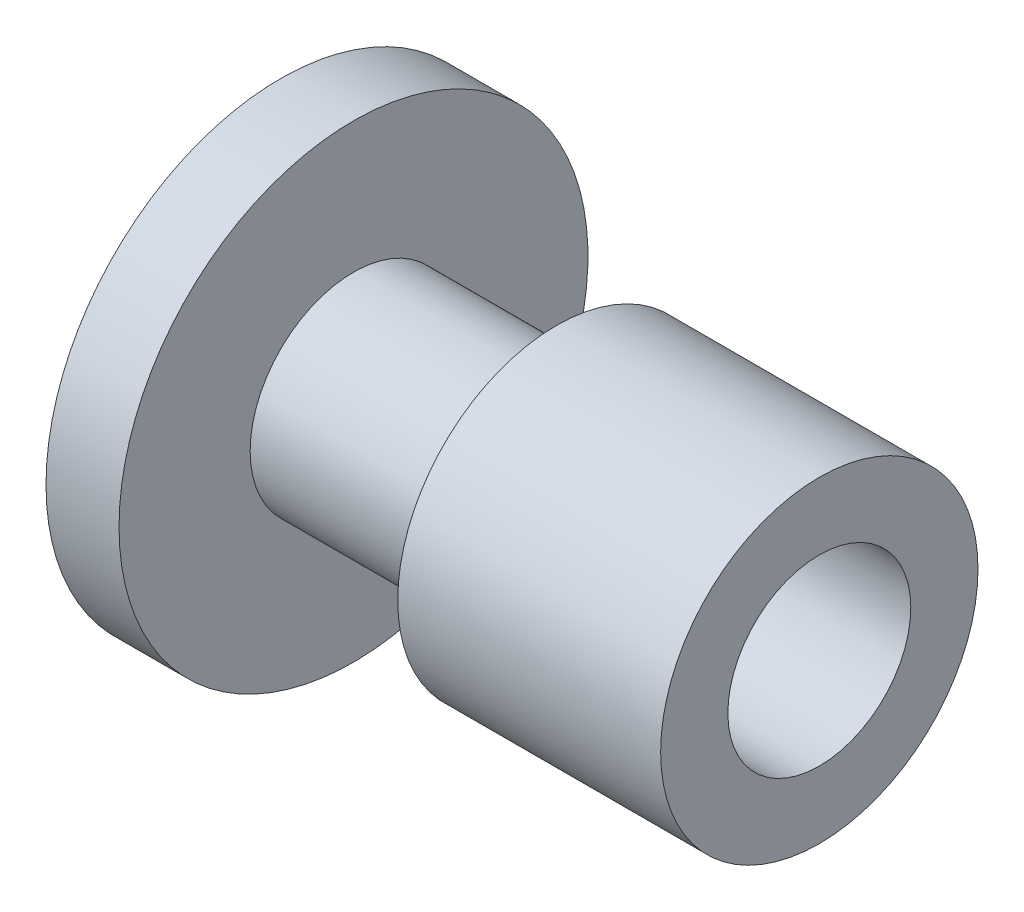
ISO-10303-21;
HEADER;
FILE_DESCRIPTION(('STEP AP214'),'2;1');
FILE_NAME('part.step','',(''),(''),'','','');
FILE_SCHEMA(('AUTOMOTIVE_DESIGN { 1 0 10303 214 1 1 1 1 }'));
ENDSEC;
DATA;
#1=APPLICATION_CONTEXT('core data for automotive mechanical design processes');
#2=APPLICATION_PROTOCOL_DEFINITION('international standard','automotive_design',2000,#1);
#3=PRODUCT_CONTEXT('',#1,'mechanical');
#4=PRODUCT('Part','Part','',(#3));
#5=PRODUCT_RELATED_PRODUCT_CATEGORY('part','',(#4));
#6=PRODUCT_DEFINITION_FORMATION('','',#4);
#7=PRODUCT_DEFINITION_CONTEXT('part definition',#1,'design');
#8=PRODUCT_DEFINITION('design','',#6,#7);
#9=PRODUCT_DEFINITION_SHAPE('','',#8);
#10=(LENGTH_UNIT() NAMED_UNIT(*) SI_UNIT(.MILLI.,.METRE.));
#11=(NAMED_UNIT(*) PLANE_ANGLE_UNIT() SI_UNIT($,.RADIAN.));
#12=(NAMED_UNIT(*) SI_UNIT($,.STERADIAN.) SOLID_ANGLE_UNIT());
#13=UNCERTAINTY_MEASURE_WITH_UNIT(LENGTH_MEASURE(1.E-05),#10,'distance_accuracy_value','');
#14=(GEOMETRIC_REPRESENTATION_CONTEXT(3) GLOBAL_UNCERTAINTY_ASSIGNED_CONTEXT((#13)) GLOBAL_UNIT_ASSIGNED_CONTEXT((#10,
#11,#12)) REPRESENTATION_CONTEXT('',''));
#15=CARTESIAN_POINT('',(0.,0.,0.));
#16=DIRECTION('',(0.,0.,1.));
#17=DIRECTION('',(1.,0.,0.));
#18=AXIS2_PLACEMENT_3D('',#15,#16,#17);
#19=CARTESIAN_POINT('',(0.,0.,0.));
#20=DIRECTION('',(-1.,0.,0.));
#21=DIRECTION('',(0.,0.,1.));
#22=AXIS2_PLACEMENT_3D('',#19,#20,#21);
#23=CYLINDRICAL_SURFACE('',#22,30.3529754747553);
#24=CARTESIAN_POINT('',(0.,0.,0.));
#25=DIRECTION('',(-1.,0.,0.));
#26=DIRECTION('',(0.,0.,1.));
#27=AXIS2_PLACEMENT_3D('',#24,#25,#26);
#28=CIRCLE('',#27,30.3529754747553);
#29=CARTESIAN_POINT('',(0.,0.,30.3529754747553));
#30=VERTEX_POINT('',#29);
#31=EDGE_CURVE('E69',#30,#30,#28,.T.);
#32=ORIENTED_EDGE('',*,*,#31,.F.);
#33=EDGE_LOOP('',(#32));
#34=FACE_BOUND('',#33,.T.);
#35=CARTESIAN_POINT('',(9.45341203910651,0.,0.));
#36=DIRECTION('',(-1.,0.,0.));
#37=DIRECTION('',(0.,0.,1.));
#38=AXIS2_PLACEMENT_3D('',#35,#36,#37);
#39=CIRCLE('',#38,30.3529754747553);
#40=CARTESIAN_POINT('',(9.45341203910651,0.,30.3529754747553));
#41=VERTEX_POINT('',#40);
#42=EDGE_CURVE('E10',#41,#41,#39,.T.);
#43=ORIENTED_EDGE('',*,*,#42,.T.);
#44=EDGE_LOOP('',(#43));
#45=FACE_BOUND('',#44,.T.);
#46=ADVANCED_FACE('F35',(#34,#45),#23,.T.);
#47=CARTESIAN_POINT('',(9.45341203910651,30.3529754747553,0.));
#48=DIRECTION('',(-1.,0.,0.));
#49=DIRECTION('',(0.,0.,1.));
#50=AXIS2_PLACEMENT_3D('',#47,#48,#49);
#51=PLANE('',#50);
#52=ORIENTED_EDGE('',*,*,#42,.F.);
#53=EDGE_LOOP('',(#52));
#54=FACE_BOUND('',#53,.T.);
#55=CARTESIAN_POINT('',(9.45341203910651,0.,0.));
#56=DIRECTION('',(-1.,0.,0.));
#57=DIRECTION('',(0.,0.,1.));
#58=AXIS2_PLACEMENT_3D('',#55,#56,#57);
#59=CIRCLE('',#58,13.3786327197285);
#60=CARTESIAN_POINT('',(9.45341203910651,0.,13.3786327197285));
#61=VERTEX_POINT('',#60);
#62=EDGE_CURVE('E41',#61,#61,#59,.T.);
#63=ORIENTED_EDGE('',*,*,#62,.T.);
#64=EDGE_LOOP('',(#63));
#65=FACE_BOUND('',#64,.T.);
#66=ADVANCED_FACE('F76',(#54,#65),#51,.F.);
#67=CARTESIAN_POINT('',(0.,0.,0.));
#68=DIRECTION('',(-1.,0.,0.));
#69=DIRECTION('',(0.,0.,1.));
#70=AXIS2_PLACEMENT_3D('',#67,#68,#69);
#71=CYLINDRICAL_SURFACE('',#70,13.3786327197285);
#72=ORIENTED_EDGE('',*,*,#62,.F.);
#73=EDGE_LOOP('',(#72));
#74=FACE_BOUND('',#73,.T.);
#75=CARTESIAN_POINT('',(35.7210094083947,0.,0.));
#76=DIRECTION('',(-1.,0.,0.));
#77=DIRECTION('',(0.,0.,1.));
#78=AXIS2_PLACEMENT_3D('',#75,#76,#77);
#79=CIRCLE('',#78,13.3786327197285);
#80=CARTESIAN_POINT('',(35.7210094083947,0.,13.3786327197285));
#81=VERTEX_POINT('',#80);
#82=EDGE_CURVE('E45',#81,#81,#79,.T.);
#83=ORIENTED_EDGE('',*,*,#82,.T.);
#84=EDGE_LOOP('',(#83));
#85=FACE_BOUND('',#84,.T.);
#86=ADVANCED_FACE('F80',(#74,#85),#71,.T.);
#87=CARTESIAN_POINT('',(35.7210094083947,13.3786327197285,0.));
#88=DIRECTION('',(1.,0.,0.));
#89=DIRECTION('',(0.,0.,-1.));
#90=AXIS2_PLACEMENT_3D('',#87,#88,#89);
#91=PLANE('',#90);
#92=ORIENTED_EDGE('',*,*,#82,.F.);
#93=EDGE_LOOP('',(#92));
#94=FACE_BOUND('',#93,.T.);
#95=CARTESIAN_POINT('',(35.7210094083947,0.,0.));
#96=DIRECTION('',(-1.,0.,0.));
#97=DIRECTION('',(0.,0.,1.));
#98=AXIS2_PLACEMENT_3D('',#95,#96,#97);
#99=CIRCLE('',#98,20.5406576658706);
#100=CARTESIAN_POINT('',(35.7210094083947,0.,20.5406576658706));
#101=VERTEX_POINT('',#100);
#102=EDGE_CURVE('E49',#101,#101,#99,.T.);
#103=ORIENTED_EDGE('',*,*,#102,.T.);
#104=EDGE_LOOP('',(#103));
#105=FACE_BOUND('',#104,.T.);
#106=ADVANCED_FACE('F85',(#94,#105),#91,.F.);
#107=CARTESIAN_POINT('',(0.,0.,0.));
#108=DIRECTION('',(-1.,0.,0.));
#109=DIRECTION('',(0.,0.,1.));
#110=AXIS2_PLACEMENT_3D('',#107,#108,#109);
#111=CYLINDRICAL_SURFACE('',#110,20.5406576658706);
#112=ORIENTED_EDGE('',*,*,#102,.F.);
#113=EDGE_LOOP('',(#112));
#114=FACE_BOUND('',#113,.T.);
#115=CARTESIAN_POINT('',(69.7560680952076,0.,0.));
#116=DIRECTION('',(-1.,0.,0.));
#117=DIRECTION('',(0.,0.,1.));
#118=AXIS2_PLACEMENT_3D('',#115,#116,#117);
#119=CIRCLE('',#118,20.5406576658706);
#120=CARTESIAN_POINT('',(69.7560680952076,0.,20.5406576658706));
#121=VERTEX_POINT('',#120);
#122=EDGE_CURVE('E54',#121,#121,#119,.T.);
#123=ORIENTED_EDGE('',*,*,#122,.T.);
#124=EDGE_LOOP('',(#123));
#125=FACE_BOUND('',#124,.T.);
#126=ADVANCED_FACE('F91',(#114,#125),#111,.T.);
#127=CARTESIAN_POINT('',(69.7560680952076,20.5406576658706,0.));
#128=DIRECTION('',(-1.,0.,0.));
#129=DIRECTION('',(0.,0.,1.));
#130=AXIS2_PLACEMENT_3D('',#127,#128,#129);
#131=PLANE('',#130);
#132=ORIENTED_EDGE('',*,*,#122,.F.);
#133=EDGE_LOOP('',(#132));
#134=FACE_BOUND('',#133,.T.);
#135=CARTESIAN_POINT('',(69.7560680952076,0.,0.));
#136=DIRECTION('',(-1.,0.,0.));
#137=DIRECTION('',(0.,0.,1.));
#138=AXIS2_PLACEMENT_3D('',#135,#136,#137);
#139=CIRCLE('',#138,11.8417275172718);
#140=CARTESIAN_POINT('',(69.7560680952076,0.,11.8417275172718));
#141=VERTEX_POINT('',#140);
#142=EDGE_CURVE('E57',#141,#141,#139,.T.);
#143=ORIENTED_EDGE('',*,*,#142,.T.);
#144=EDGE_LOOP('',(#143));
#145=FACE_BOUND('',#144,.T.);
#146=ADVANCED_FACE('F95',(#134,#145),#131,.F.);
#147=CARTESIAN_POINT('',(0.,0.,0.));
#148=DIRECTION('',(-1.,0.,0.));
#149=DIRECTION('',(0.,0.,1.));
#150=AXIS2_PLACEMENT_3D('',#147,#148,#149);
#151=CYLINDRICAL_SURFACE('',#150,11.8417275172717);
#152=ORIENTED_EDGE('',*,*,#142,.F.);
#153=EDGE_LOOP('',(#152));
#154=FACE_BOUND('',#153,.T.);
#155=CARTESIAN_POINT('',(46.1235843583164,0.,0.));
#156=DIRECTION('',(-1.,0.,0.));
#157=DIRECTION('',(0.,0.,1.));
#158=AXIS2_PLACEMENT_3D('',#155,#156,#157);
#159=CIRCLE('',#158,11.8417275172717);
#160=CARTESIAN_POINT('',(46.1235843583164,0.,11.8417275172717));
#161=VERTEX_POINT('',#160);
#162=EDGE_CURVE('E60',#161,#161,#159,.T.);
#163=ORIENTED_EDGE('',*,*,#162,.T.);
#164=EDGE_LOOP('',(#163));
#165=FACE_BOUND('',#164,.T.);
#166=ADVANCED_FACE('F99',(#154,#165),#151,.F.);
#167=CARTESIAN_POINT('',(46.1235843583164,11.8417275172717,0.));
#168=DIRECTION('',(-1.,0.,0.));
#169=DIRECTION('',(0.,0.,1.));
#170=AXIS2_PLACEMENT_3D('',#167,#168,#169);
#171=PLANE('',#170);
#172=ORIENTED_EDGE('',*,*,#162,.F.);
#173=EDGE_LOOP('',(#172));
#174=FACE_BOUND('',#173,.T.);
#175=CARTESIAN_POINT('',(46.1235843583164,0.,0.));
#176=DIRECTION('',(-1.,0.,0.));
#177=DIRECTION('',(0.,0.,1.));
#178=AXIS2_PLACEMENT_3D('',#175,#176,#177);
#179=CIRCLE('',#178,5.73226952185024);
#180=CARTESIAN_POINT('',(46.1235843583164,0.,5.73226952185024));
#181=VERTEX_POINT('',#180);
#182=EDGE_CURVE('E63',#181,#181,#179,.T.);
#183=ORIENTED_EDGE('',*,*,#182,.T.);
#184=EDGE_LOOP('',(#183));
#185=FACE_BOUND('',#184,.T.);
#186=ADVANCED_FACE('F103',(#174,#185),#171,.F.);
#187=CARTESIAN_POINT('',(0.,0.,0.));
#188=DIRECTION('',(-1.,0.,0.));
#189=DIRECTION('',(0.,0.,1.));
#190=AXIS2_PLACEMENT_3D('',#187,#188,#189);
#191=CYLINDRICAL_SURFACE('',#190,5.73226952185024);
#192=ORIENTED_EDGE('',*,*,#182,.F.);
#193=EDGE_LOOP('',(#192));
#194=FACE_BOUND('',#193,.T.);
#195=CARTESIAN_POINT('',(7.54748927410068,0.,0.));
#196=DIRECTION('',(-1.,0.,0.));
#197=DIRECTION('',(0.,0.,1.));
#198=AXIS2_PLACEMENT_3D('',#195,#196,#197);
#199=CIRCLE('',#198,5.73226952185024);
#200=CARTESIAN_POINT('',(7.54748927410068,0.,5.73226952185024));
#201=VERTEX_POINT('',#200);
#202=EDGE_CURVE('E66',#201,#201,#199,.T.);
#203=ORIENTED_EDGE('',*,*,#202,.T.);
#204=EDGE_LOOP('',(#203));
#205=FACE_BOUND('',#204,.T.);
#206=ADVANCED_FACE('F107',(#194,#205),#191,.F.);
#207=CARTESIAN_POINT('',(7.54748927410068,5.73226952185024,0.));
#208=DIRECTION('',(-1.,0.,0.));
#209=DIRECTION('',(0.,0.,1.));
#210=AXIS2_PLACEMENT_3D('',#207,#208,#209);
#211=PLANE('',#210);
#212=ORIENTED_EDGE('',*,*,#202,.F.);
#213=EDGE_LOOP('',(#212));
#214=FACE_BOUND('',#213,.T.);
#215=ADVANCED_FACE('F111',(#214),#211,.F.);
#216=CARTESIAN_POINT('',(0.,0.,0.));
#217=DIRECTION('',(1.,0.,0.));
#218=DIRECTION('',(0.,0.,-1.));
#219=AXIS2_PLACEMENT_3D('',#216,#217,#218);
#220=PLANE('',#219);
#221=ORIENTED_EDGE('',*,*,#31,.T.);
#222=EDGE_LOOP('',(#221));
#223=FACE_BOUND('',#222,.T.);
#224=ADVANCED_FACE('F73',(#223),#220,.F.);
#225=CLOSED_SHELL('',(#46,#66,#86,#106,#126,#146,#166,#186,#206,#215,#224));
#226=MANIFOLD_SOLID_BREP('B2',#225);
#227=ADVANCED_BREP_SHAPE_REPRESENTATION('',(#18,#226),#14);
#228=SHAPE_DEFINITION_REPRESENTATION(#9,#227);
ENDSEC;
END-ISO-10303-21;
